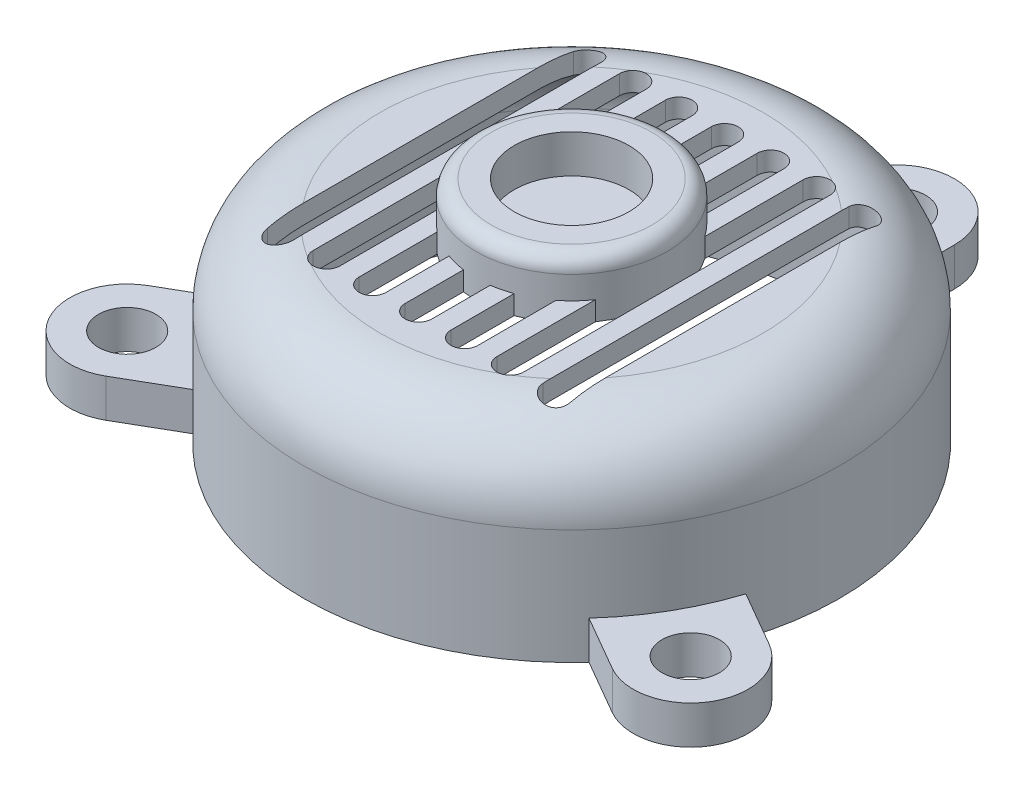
from build123d import *

# Parameters (mm, degrees)
SHELL1_T            = -2.5
SKETCH2_R           = 3.75
BOSS_EXTRUDE1_DEPTH = 5
CIRPATTERN1_COUNT   = 6
CUT_EXTRUDE2_REACH  = 73.33
LPATTERN1_COUNT     = 7
LPATTERN1_PITCH     = 6
SKETCH3_R           = 12.5
BOSS_EXTRUDE2_DEPTH = 7.5
SKETCH4_R           = 7.5
CUT_EXTRUDE1_DEPTH  = 5
FILLET1_R           = 2


with BuildPart() as part:
    # Sketch1 → Revolve1 (revolve)
    with BuildSketch(Plane.XY, mode=Mode.PRIVATE) as revolve1_sk:
        with BuildLine():
            Line((0, 0), (0, 25))
            Line((0, 25), (25, 25))
            ThreePointArc((25, 25), (32.071067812, 22.071067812), (35, 15))
            Line((35, 15), (35, 0))
            Line((35, 0), (0, 0))
        make_face()
    revolve(revolve1_sk.sketch.rotate(Axis((0, 49.849509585, 0), (0, -1, 0)), 90), axis=Axis((0, 49.849509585, 0), (0, -1, 0)))

    # Shell1
    shell1_openings = [part.faces().sort_by_distance(p)[0] for p in [
        (0, 0, 0),
    ]]
    offset(amount=SHELL1_T, openings=shell1_openings, kind=Kind.INTERSECTION)

    # Sketch2 → Boss-Extrude1 (add)
    with BuildSketch(Plane(origin=(0, 0, 0), x_dir=(1, 0, 0), z_dir=(0, 1, 0))):
        with BuildLine():
            Line((-7.5, 42.5), (-7.5, 34.186985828))
            ThreePointArc((-7.5, 34.186985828), (0, 35), (7.5, 34.186985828))
            Line((7.5, 34.186985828), (7.5, 42.5))
            ThreePointArc((7.5, 42.5), (0, 50), (-7.5, 42.5))
        make_face()
        with Locations(Location((0, 42.5, 0), (0, 0, 270))):
            Circle(SKETCH2_R, mode=Mode.SUBTRACT)
    boss_extrude1 = extrude(amount=BOSS_EXTRUDE1_DEPTH)

    # CirPattern1: Boss-Extrude1 ×6 about axis, 3 skipped
    cirpattern1_axis = Axis((0, 0, 0), (0, 1, 0))
    add([boss_extrude1.rotate(cirpattern1_axis, i * 360 / CIRPATTERN1_COUNT) for i in range(1, CIRPATTERN1_COUNT) if i not in (1, 3, 5)])

    # Sketch5 → Cut-Extrude2 (cut, up to next)
    with BuildSketch(Plane(origin=(0, 25, 0), x_dir=(1, 0, 0), z_dir=(0, 1, 0)), mode=Mode.PRIVATE) as cut_extrude2_sk1:
        with BuildLine():
            Line((-16.25, 20), (-16.25, -20))
            ThreePointArc((-16.25, -20), (-18, -21.75), (-19.75, -20))
            Line((-19.75, -20), (-19.75, 20))
            ThreePointArc((-19.75, 20), (-18, 21.75), (-16.25, 20))
        make_face()
    cut_extrude2_tool1 = extrude(cut_extrude2_sk1.sketch, amount=-CUT_EXTRUDE2_REACH, mode=Mode.PRIVATE) & part.part
    cut_extrude2 = cut_extrude2_tool1.solids().sort_by_distance((-18, 25, 0))[0]
    add(cut_extrude2, mode=Mode.SUBTRACT)

    # LPattern1: Cut-Extrude2; each copy of Cut-Extrude2 runs up to whatever stops it at its own place
    lpattern1_before = part.part  # the part as the pattern finds it: every copy runs up to it
    lpattern1_cut_extrude2_long = extrude(cut_extrude2_sk1.sketch, amount=-CUT_EXTRUDE2_REACH, mode=Mode.PRIVATE)
    lpattern1_cut_extrude2_tool1 = lpattern1_cut_extrude2_long.moved(Location(Vector(1, 0, 0) * (1 * LPATTERN1_PITCH))) & lpattern1_before
    add(lpattern1_cut_extrude2_tool1.solids().sort_by_distance((-12, 25, 0))[0], mode=Mode.SUBTRACT)
    lpattern1_cut_extrude2_tool2 = lpattern1_cut_extrude2_long.moved(Location(Vector(1, 0, 0) * (2 * LPATTERN1_PITCH))) & lpattern1_before
    add(lpattern1_cut_extrude2_tool2.solids().sort_by_distance((-6, 25, 0))[0], mode=Mode.SUBTRACT)
    lpattern1_cut_extrude2_tool3 = lpattern1_cut_extrude2_long.moved(Location(Vector(1, 0, 0) * (3 * LPATTERN1_PITCH))) & lpattern1_before
    add(lpattern1_cut_extrude2_tool3.solids().sort_by_distance((0, 25, 0))[0], mode=Mode.SUBTRACT)
    lpattern1_cut_extrude2_tool4 = lpattern1_cut_extrude2_long.moved(Location(Vector(1, 0, 0) * (4 * LPATTERN1_PITCH))) & lpattern1_before
    add(lpattern1_cut_extrude2_tool4.solids().sort_by_distance((6, 25, 0))[0], mode=Mode.SUBTRACT)
    lpattern1_cut_extrude2_tool5 = lpattern1_cut_extrude2_long.moved(Location(Vector(1, 0, 0) * (5 * LPATTERN1_PITCH))) & lpattern1_before
    add(lpattern1_cut_extrude2_tool5.solids().sort_by_distance((12, 25, 0))[0], mode=Mode.SUBTRACT)
    lpattern1_cut_extrude2_tool6 = lpattern1_cut_extrude2_long.moved(Location(Vector(1, 0, 0) * (6 * LPATTERN1_PITCH))) & lpattern1_before
    add(lpattern1_cut_extrude2_tool6.solids().sort_by_distance((18, 25, 0))[0], mode=Mode.SUBTRACT)

    # Sketch3 → Boss-Extrude2 (add)
    with BuildSketch(Plane(origin=(0, 22.5, 0), x_dir=(1, 0, 0), z_dir=(0, 1, 0))):
        with Locations(Location((0, 0, 0), (0, 0, 98.047846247))):
            Circle(SKETCH3_R)
    extrude(amount=BOSS_EXTRUDE2_DEPTH)

    # Sketch4 → Cut-Extrude1 (cut)
    with BuildSketch(Plane(origin=(0, 30, 0), x_dir=(1, 0, 0), z_dir=(0, 1, 0))):
        with Locations(Location((0, 0, 0), (0, 0, 270))):
            Circle(SKETCH4_R)
    extrude(amount=-CUT_EXTRUDE1_DEPTH, mode=Mode.SUBTRACT)

    # Fillet1
    fillet1_edges = [part.edges().sort_by_distance(p)[0] for p in [
        (1.75, 30, 12.376893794),
    ]]
    fillet(fillet1_edges, radius=FILLET1_R)


solid = part.part
